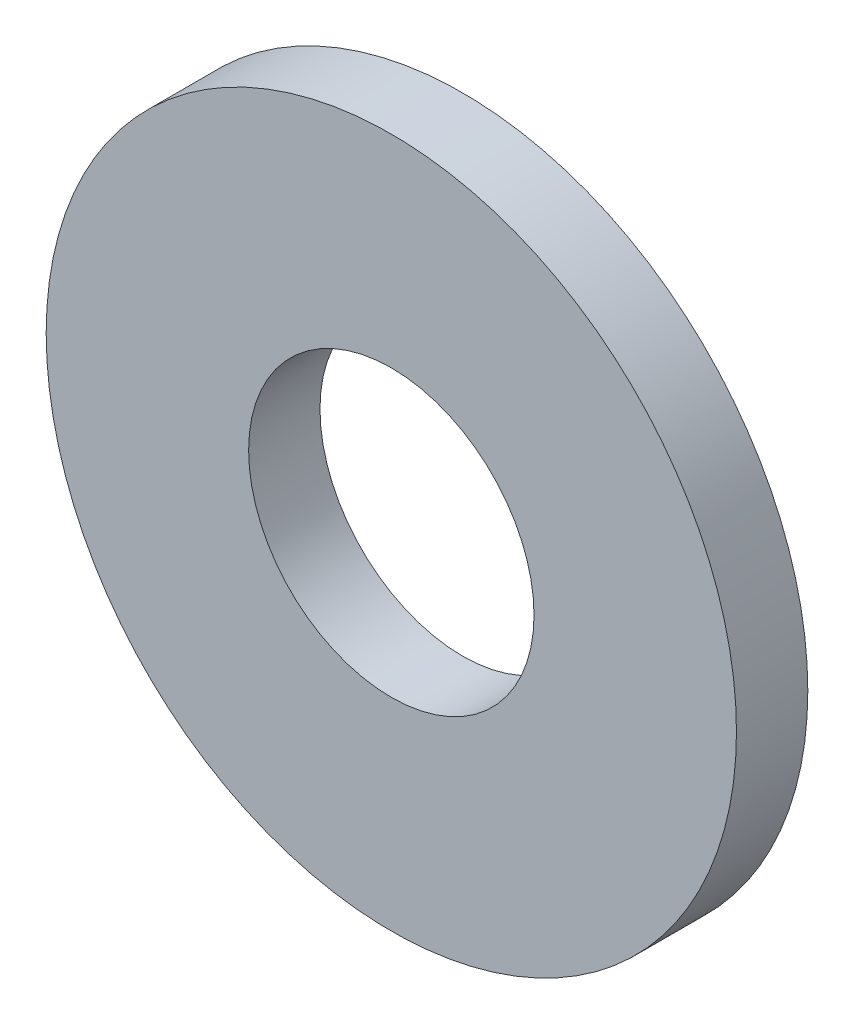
ISO-10303-21;
HEADER;
FILE_DESCRIPTION(('STEP AP214'),'2;1');
FILE_NAME('part.step','',(''),(''),'','','');
FILE_SCHEMA(('AUTOMOTIVE_DESIGN { 1 0 10303 214 1 1 1 1 }'));
ENDSEC;
DATA;
#1=APPLICATION_CONTEXT('core data for automotive mechanical design processes');
#2=APPLICATION_PROTOCOL_DEFINITION('international standard','automotive_design',2000,#1);
#3=PRODUCT_CONTEXT('',#1,'mechanical');
#4=PRODUCT('Part','Part','',(#3));
#5=PRODUCT_RELATED_PRODUCT_CATEGORY('part','',(#4));
#6=PRODUCT_DEFINITION_FORMATION('','',#4);
#7=PRODUCT_DEFINITION_CONTEXT('part definition',#1,'design');
#8=PRODUCT_DEFINITION('design','',#6,#7);
#9=PRODUCT_DEFINITION_SHAPE('','',#8);
#10=(LENGTH_UNIT() NAMED_UNIT(*) SI_UNIT(.MILLI.,.METRE.));
#11=(NAMED_UNIT(*) PLANE_ANGLE_UNIT() SI_UNIT($,.RADIAN.));
#12=(NAMED_UNIT(*) SI_UNIT($,.STERADIAN.) SOLID_ANGLE_UNIT());
#13=UNCERTAINTY_MEASURE_WITH_UNIT(LENGTH_MEASURE(1.E-05),#10,'distance_accuracy_value','');
#14=(GEOMETRIC_REPRESENTATION_CONTEXT(3) GLOBAL_UNCERTAINTY_ASSIGNED_CONTEXT((#13)) GLOBAL_UNIT_ASSIGNED_CONTEXT((#10,
#11,#12)) REPRESENTATION_CONTEXT('',''));
#15=CARTESIAN_POINT('',(0.,0.,0.));
#16=DIRECTION('',(0.,0.,1.));
#17=DIRECTION('',(1.,0.,0.));
#18=AXIS2_PLACEMENT_3D('',#15,#16,#17);
#19=CARTESIAN_POINT('',(0.,0.,1.016));
#20=DIRECTION('',(0.,0.,1.));
#21=DIRECTION('',(1.,0.,0.));
#22=AXIS2_PLACEMENT_3D('',#19,#20,#21);
#23=PLANE('',#22);
#24=CARTESIAN_POINT('',(0.,0.,1.016));
#25=DIRECTION('',(0.,0.,1.));
#26=DIRECTION('',(1.,0.,0.));
#27=AXIS2_PLACEMENT_3D('',#24,#25,#26);
#28=CIRCLE('',#27,4.9149);
#29=CARTESIAN_POINT('',(4.9149,0.,1.016));
#30=VERTEX_POINT('',#29);
#31=EDGE_CURVE('E10',#30,#30,#28,.T.);
#32=ORIENTED_EDGE('',*,*,#31,.T.);
#33=EDGE_LOOP('',(#32));
#34=FACE_BOUND('',#33,.T.);
#35=CARTESIAN_POINT('',(0.,0.,1.016));
#36=DIRECTION('',(0.,0.,1.));
#37=DIRECTION('',(1.,0.,0.));
#38=AXIS2_PLACEMENT_3D('',#35,#36,#37);
#39=CIRCLE('',#38,2.032);
#40=CARTESIAN_POINT('',(2.032,0.,1.016));
#41=VERTEX_POINT('',#40);
#42=EDGE_CURVE('E42',#41,#41,#39,.T.);
#43=ORIENTED_EDGE('',*,*,#42,.F.);
#44=EDGE_LOOP('',(#43));
#45=FACE_BOUND('',#44,.T.);
#46=ADVANCED_FACE('F31',(#34,#45),#23,.T.);
#47=CARTESIAN_POINT('',(0.,0.,0.));
#48=DIRECTION('',(0.,0.,1.));
#49=DIRECTION('',(1.,0.,0.));
#50=AXIS2_PLACEMENT_3D('',#47,#48,#49);
#51=PLANE('',#50);
#52=CARTESIAN_POINT('',(0.,0.,0.));
#53=DIRECTION('',(0.,0.,1.));
#54=DIRECTION('',(1.,0.,0.));
#55=AXIS2_PLACEMENT_3D('',#52,#53,#54);
#56=CIRCLE('',#55,4.9149);
#57=CARTESIAN_POINT('',(4.9149,0.,0.));
#58=VERTEX_POINT('',#57);
#59=EDGE_CURVE('E35',#58,#58,#56,.T.);
#60=ORIENTED_EDGE('',*,*,#59,.F.);
#61=EDGE_LOOP('',(#60));
#62=FACE_BOUND('',#61,.T.);
#63=CARTESIAN_POINT('',(0.,0.,0.));
#64=DIRECTION('',(0.,0.,1.));
#65=DIRECTION('',(1.,0.,0.));
#66=AXIS2_PLACEMENT_3D('',#63,#64,#65);
#67=CIRCLE('',#66,2.032);
#68=CARTESIAN_POINT('',(2.032,0.,0.));
#69=VERTEX_POINT('',#68);
#70=EDGE_CURVE('E44',#69,#69,#67,.T.);
#71=ORIENTED_EDGE('',*,*,#70,.T.);
#72=EDGE_LOOP('',(#71));
#73=FACE_BOUND('',#72,.T.);
#74=ADVANCED_FACE('F54',(#62,#73),#51,.F.);
#75=CARTESIAN_POINT('',(0.,0.,1.016));
#76=DIRECTION('',(0.,0.,-1.));
#77=DIRECTION('',(-1.,0.,0.));
#78=AXIS2_PLACEMENT_3D('',#75,#76,#77);
#79=CYLINDRICAL_SURFACE('',#78,4.9149);
#80=ORIENTED_EDGE('',*,*,#31,.F.);
#81=EDGE_LOOP('',(#80));
#82=FACE_BOUND('',#81,.T.);
#83=ORIENTED_EDGE('',*,*,#59,.T.);
#84=EDGE_LOOP('',(#83));
#85=FACE_BOUND('',#84,.T.);
#86=ADVANCED_FACE('F33',(#82,#85),#79,.T.);
#87=CARTESIAN_POINT('',(0.,0.,1.016));
#88=DIRECTION('',(0.,0.,-1.));
#89=DIRECTION('',(-1.,0.,0.));
#90=AXIS2_PLACEMENT_3D('',#87,#88,#89);
#91=CYLINDRICAL_SURFACE('',#90,2.032);
#92=ORIENTED_EDGE('',*,*,#42,.T.);
#93=EDGE_LOOP('',(#92));
#94=FACE_BOUND('',#93,.T.);
#95=ORIENTED_EDGE('',*,*,#70,.F.);
#96=EDGE_LOOP('',(#95));
#97=FACE_BOUND('',#96,.T.);
#98=ADVANCED_FACE('F50',(#94,#97),#91,.F.);
#99=CLOSED_SHELL('',(#46,#74,#86,#98));
#100=MANIFOLD_SOLID_BREP('B2',#99);
#101=ADVANCED_BREP_SHAPE_REPRESENTATION('',(#18,#100),#14);
#102=SHAPE_DEFINITION_REPRESENTATION(#9,#101);
ENDSEC;
END-ISO-10303-21;
